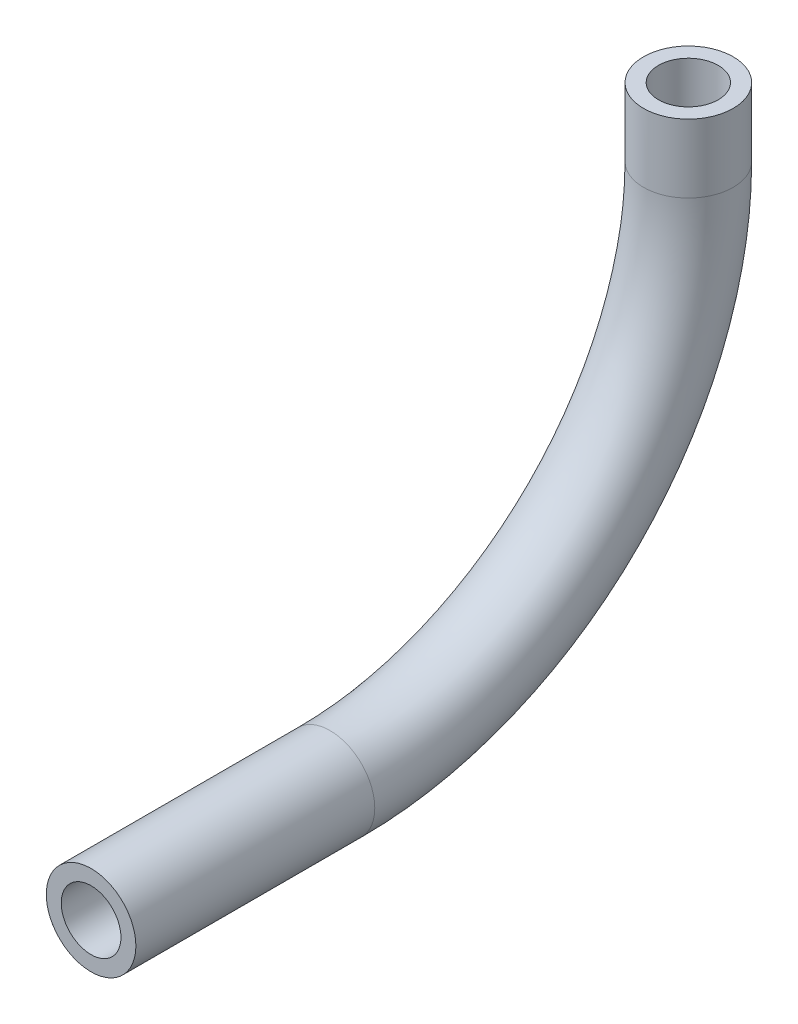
ISO-10303-21;
HEADER;
FILE_DESCRIPTION(('STEP AP214'),'2;1');
FILE_NAME('part.step','',(''),(''),'','','');
FILE_SCHEMA(('AUTOMOTIVE_DESIGN { 1 0 10303 214 1 1 1 1 }'));
ENDSEC;
DATA;
#1=APPLICATION_CONTEXT('core data for automotive mechanical design processes');
#2=APPLICATION_PROTOCOL_DEFINITION('international standard','automotive_design',2000,#1);
#3=PRODUCT_CONTEXT('',#1,'mechanical');
#4=PRODUCT('Part','Part','',(#3));
#5=PRODUCT_RELATED_PRODUCT_CATEGORY('part','',(#4));
#6=PRODUCT_DEFINITION_FORMATION('','',#4);
#7=PRODUCT_DEFINITION_CONTEXT('part definition',#1,'design');
#8=PRODUCT_DEFINITION('design','',#6,#7);
#9=PRODUCT_DEFINITION_SHAPE('','',#8);
#10=(LENGTH_UNIT() NAMED_UNIT(*) SI_UNIT(.MILLI.,.METRE.));
#11=(NAMED_UNIT(*) PLANE_ANGLE_UNIT() SI_UNIT($,.RADIAN.));
#12=(NAMED_UNIT(*) SI_UNIT($,.STERADIAN.) SOLID_ANGLE_UNIT());
#13=UNCERTAINTY_MEASURE_WITH_UNIT(LENGTH_MEASURE(1.E-05),#10,'distance_accuracy_value','');
#14=(GEOMETRIC_REPRESENTATION_CONTEXT(3) GLOBAL_UNCERTAINTY_ASSIGNED_CONTEXT((#13)) GLOBAL_UNIT_ASSIGNED_CONTEXT((#10,
#11,#12)) REPRESENTATION_CONTEXT('',''));
#15=CARTESIAN_POINT('',(0.,0.,0.));
#16=DIRECTION('',(0.,0.,1.));
#17=DIRECTION('',(1.,0.,0.));
#18=AXIS2_PLACEMENT_3D('',#15,#16,#17);
#19=CARTESIAN_POINT('',(0.,76.2,-127.));
#20=DIRECTION('',(0.,1.,0.));
#21=DIRECTION('',(0.,0.,1.));
#22=AXIS2_PLACEMENT_3D('',#19,#20,#21);
#23=CYLINDRICAL_SURFACE('',#22,9.525);
#24=CARTESIAN_POINT('',(0.,76.2,-127.));
#25=DIRECTION('',(0.,-1.,0.));
#26=DIRECTION('',(1.,0.,0.));
#27=AXIS2_PLACEMENT_3D('',#24,#25,#26);
#28=CIRCLE('',#27,9.525);
#29=CARTESIAN_POINT('',(0.,76.2,-136.525));
#30=VERTEX_POINT('',#29);
#31=EDGE_CURVE('E45',#30,#30,#28,.T.);
#32=ORIENTED_EDGE('',*,*,#31,.F.);
#33=EDGE_LOOP('',(#32));
#34=FACE_BOUND('',#33,.T.);
#35=CARTESIAN_POINT('',(0.,90.7404090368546,-127.));
#36=DIRECTION('',(0.,-1.,0.));
#37=DIRECTION('',(1.,0.,0.));
#38=AXIS2_PLACEMENT_3D('',#35,#36,#37);
#39=CIRCLE('',#38,9.525);
#40=CARTESIAN_POINT('',(9.525,90.7404090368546,-127.));
#41=VERTEX_POINT('',#40);
#42=EDGE_CURVE('E10',#41,#41,#39,.T.);
#43=ORIENTED_EDGE('',*,*,#42,.T.);
#44=EDGE_LOOP('',(#43));
#45=FACE_BOUND('',#44,.T.);
#46=ADVANCED_FACE('F33',(#34,#45),#23,.T.);
#47=CARTESIAN_POINT('',(0.,76.2,-127.));
#48=DIRECTION('',(0.,1.,0.));
#49=DIRECTION('',(0.,0.,1.));
#50=AXIS2_PLACEMENT_3D('',#47,#48,#49);
#51=CYLINDRICAL_SURFACE('',#50,6.35);
#52=CARTESIAN_POINT('',(0.,76.2,-127.));
#53=DIRECTION('',(0.,-1.,0.));
#54=DIRECTION('',(1.,0.,0.));
#55=AXIS2_PLACEMENT_3D('',#52,#53,#54);
#56=CIRCLE('',#55,6.35);
#57=CARTESIAN_POINT('',(0.,76.2,-133.35));
#58=VERTEX_POINT('',#57);
#59=EDGE_CURVE('E50',#58,#58,#56,.T.);
#60=ORIENTED_EDGE('',*,*,#59,.T.);
#61=EDGE_LOOP('',(#60));
#62=FACE_BOUND('',#61,.T.);
#63=CARTESIAN_POINT('',(0.,90.7404090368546,-127.));
#64=DIRECTION('',(0.,-1.,0.));
#65=DIRECTION('',(1.,0.,0.));
#66=AXIS2_PLACEMENT_3D('',#63,#64,#65);
#67=CIRCLE('',#66,6.35);
#68=CARTESIAN_POINT('',(6.35,90.7404090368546,-127.));
#69=VERTEX_POINT('',#68);
#70=EDGE_CURVE('E40',#69,#69,#67,.T.);
#71=ORIENTED_EDGE('',*,*,#70,.F.);
#72=EDGE_LOOP('',(#71));
#73=FACE_BOUND('',#72,.T.);
#74=ADVANCED_FACE('F94',(#62,#73),#51,.F.);
#75=CARTESIAN_POINT('',(0.,76.2,-50.8));
#76=DIRECTION('',(1.,0.,0.));
#77=DIRECTION('',(0.,0.,-1.));
#78=AXIS2_PLACEMENT_3D('',#75,#76,#77);
#79=TOROIDAL_SURFACE('',#78,76.2,9.525);
#80=CARTESIAN_POINT('',(0.,0.,-50.8));
#81=DIRECTION('',(0.,0.,1.));
#82=DIRECTION('',(1.,0.,0.));
#83=AXIS2_PLACEMENT_3D('',#80,#81,#82);
#84=CIRCLE('',#83,9.525);
#85=CARTESIAN_POINT('',(0.,-9.52499999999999,-50.8));
#86=VERTEX_POINT('',#85);
#87=EDGE_CURVE('E56',#86,#86,#84,.T.);
#88=CARTESIAN_POINT('',(0.,76.2,-50.8));
#89=DIRECTION('',(1.,0.,0.));
#90=DIRECTION('',(0.,0.,-1.));
#91=AXIS2_PLACEMENT_3D('',#88,#89,#90);
#92=CIRCLE('',#91,85.725);
#93=EDGE_CURVE('',#86,#30,#92,.T.);
#94=ORIENTED_EDGE('',*,*,#87,.F.);
#95=ORIENTED_EDGE('',*,*,#31,.T.);
#96=ORIENTED_EDGE('',*,*,#93,.T.);
#97=ORIENTED_EDGE('',*,*,#93,.F.);
#98=EDGE_LOOP('',(#94,#96,#95,#97));
#99=FACE_BOUND('',#98,.T.);
#100=ADVANCED_FACE('F99',(#99),#79,.T.);
#101=CARTESIAN_POINT('',(0.,76.2,-50.8));
#102=DIRECTION('',(1.,0.,0.));
#103=DIRECTION('',(0.,0.,-1.));
#104=AXIS2_PLACEMENT_3D('',#101,#102,#103);
#105=TOROIDAL_SURFACE('',#104,76.2,6.35);
#106=CARTESIAN_POINT('',(0.,0.,-50.8));
#107=DIRECTION('',(0.,0.,1.));
#108=DIRECTION('',(1.,0.,0.));
#109=AXIS2_PLACEMENT_3D('',#106,#107,#108);
#110=CIRCLE('',#109,6.35);
#111=CARTESIAN_POINT('',(0.,-6.34999999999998,-50.8));
#112=VERTEX_POINT('',#111);
#113=EDGE_CURVE('E60',#112,#112,#110,.T.);
#114=CARTESIAN_POINT('',(0.,76.2,-50.8));
#115=DIRECTION('',(1.,0.,0.));
#116=DIRECTION('',(0.,0.,-1.));
#117=AXIS2_PLACEMENT_3D('',#114,#115,#116);
#118=CIRCLE('',#117,82.55);
#119=EDGE_CURVE('',#112,#58,#118,.T.);
#120=ORIENTED_EDGE('',*,*,#113,.T.);
#121=ORIENTED_EDGE('',*,*,#59,.F.);
#122=ORIENTED_EDGE('',*,*,#119,.T.);
#123=ORIENTED_EDGE('',*,*,#119,.F.);
#124=EDGE_LOOP('',(#120,#122,#121,#123));
#125=FACE_BOUND('',#124,.T.);
#126=ADVANCED_FACE('F69',(#125),#105,.F.);
#127=CARTESIAN_POINT('',(0.,0.,-50.8));
#128=DIRECTION('',(0.,0.,1.));
#129=DIRECTION('',(1.,0.,0.));
#130=AXIS2_PLACEMENT_3D('',#127,#128,#129);
#131=CYLINDRICAL_SURFACE('',#130,6.35);
#132=ORIENTED_EDGE('',*,*,#113,.F.);
#133=EDGE_LOOP('',(#132));
#134=FACE_BOUND('',#133,.T.);
#135=CARTESIAN_POINT('',(0.,0.,0.));
#136=DIRECTION('',(0.,0.,1.));
#137=DIRECTION('',(1.,0.,0.));
#138=AXIS2_PLACEMENT_3D('',#135,#136,#137);
#139=CIRCLE('',#138,6.35);
#140=CARTESIAN_POINT('',(6.35,0.,0.));
#141=VERTEX_POINT('',#140);
#142=EDGE_CURVE('E61',#141,#141,#139,.T.);
#143=ORIENTED_EDGE('',*,*,#142,.T.);
#144=EDGE_LOOP('',(#143));
#145=FACE_BOUND('',#144,.T.);
#146=ADVANCED_FACE('F72',(#134,#145),#131,.F.);
#147=CARTESIAN_POINT('',(0.,0.,-50.8));
#148=DIRECTION('',(0.,0.,1.));
#149=DIRECTION('',(1.,0.,0.));
#150=AXIS2_PLACEMENT_3D('',#147,#148,#149);
#151=CYLINDRICAL_SURFACE('',#150,9.525);
#152=ORIENTED_EDGE('',*,*,#87,.T.);
#153=EDGE_LOOP('',(#152));
#154=FACE_BOUND('',#153,.T.);
#155=CARTESIAN_POINT('',(0.,0.,0.));
#156=DIRECTION('',(0.,0.,1.));
#157=DIRECTION('',(1.,0.,0.));
#158=AXIS2_PLACEMENT_3D('',#155,#156,#157);
#159=CIRCLE('',#158,9.525);
#160=CARTESIAN_POINT('',(9.525,0.,0.));
#161=VERTEX_POINT('',#160);
#162=EDGE_CURVE('E57',#161,#161,#159,.T.);
#163=ORIENTED_EDGE('',*,*,#162,.F.);
#164=EDGE_LOOP('',(#163));
#165=FACE_BOUND('',#164,.T.);
#166=ADVANCED_FACE('F75',(#154,#165),#151,.T.);
#167=CARTESIAN_POINT('',(0.,90.7404090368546,-127.));
#168=DIRECTION('',(0.,-1.,0.));
#169=DIRECTION('',(1.,0.,0.));
#170=AXIS2_PLACEMENT_3D('',#167,#168,#169);
#171=PLANE('',#170);
#172=ORIENTED_EDGE('',*,*,#70,.T.);
#173=EDGE_LOOP('',(#172));
#174=FACE_BOUND('',#173,.T.);
#175=ORIENTED_EDGE('',*,*,#42,.F.);
#176=EDGE_LOOP('',(#175));
#177=FACE_BOUND('',#176,.T.);
#178=ADVANCED_FACE('F82',(#174,#177),#171,.F.);
#179=CARTESIAN_POINT('',(0.,0.,0.));
#180=DIRECTION('',(0.,0.,1.));
#181=DIRECTION('',(1.,0.,0.));
#182=AXIS2_PLACEMENT_3D('',#179,#180,#181);
#183=PLANE('',#182);
#184=ORIENTED_EDGE('',*,*,#142,.F.);
#185=EDGE_LOOP('',(#184));
#186=FACE_BOUND('',#185,.T.);
#187=ORIENTED_EDGE('',*,*,#162,.T.);
#188=EDGE_LOOP('',(#187));
#189=FACE_BOUND('',#188,.T.);
#190=ADVANCED_FACE('F79',(#186,#189),#183,.T.);
#191=CLOSED_SHELL('',(#46,#74,#100,#126,#146,#166,#178,#190));
#192=MANIFOLD_SOLID_BREP('B2',#191);
#193=ADVANCED_BREP_SHAPE_REPRESENTATION('',(#18,#192),#14);
#194=SHAPE_DEFINITION_REPRESENTATION(#9,#193);
ENDSEC;
END-ISO-10303-21;
